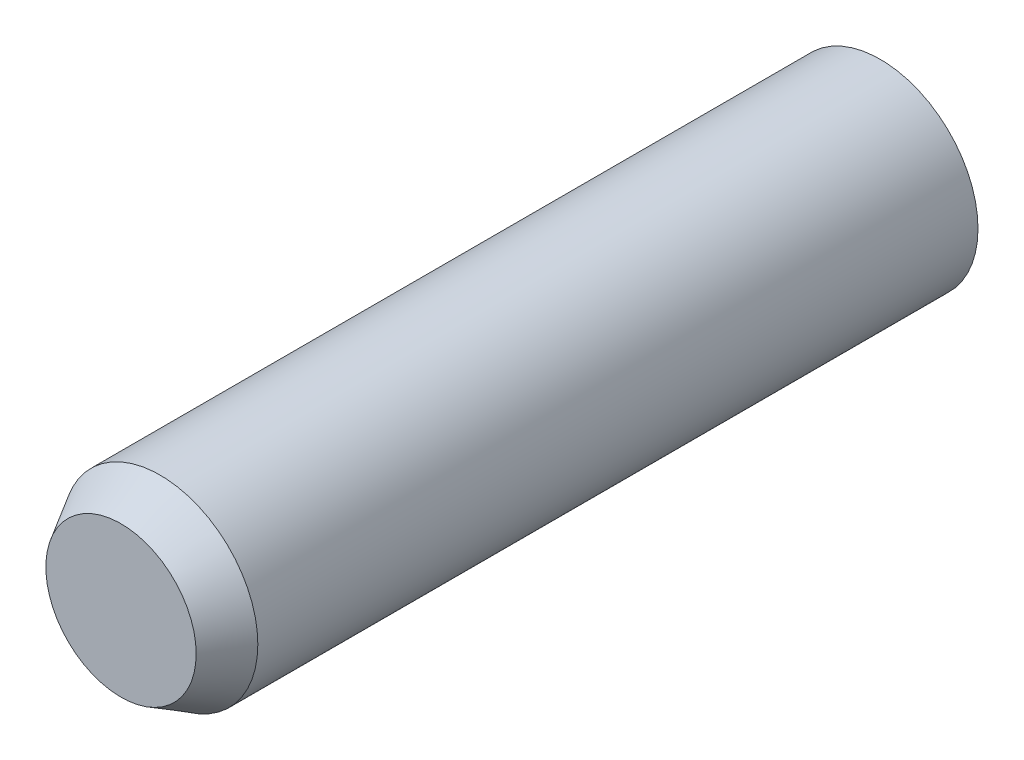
ISO-10303-21;
HEADER;
FILE_DESCRIPTION(('STEP AP214'),'2;1');
FILE_NAME('part.step','',(''),(''),'','','');
FILE_SCHEMA(('AUTOMOTIVE_DESIGN { 1 0 10303 214 1 1 1 1 }'));
ENDSEC;
DATA;
#1=APPLICATION_CONTEXT('core data for automotive mechanical design processes');
#2=APPLICATION_PROTOCOL_DEFINITION('international standard','automotive_design',2000,#1);
#3=PRODUCT_CONTEXT('',#1,'mechanical');
#4=PRODUCT('Part','Part','',(#3));
#5=PRODUCT_RELATED_PRODUCT_CATEGORY('part','',(#4));
#6=PRODUCT_DEFINITION_FORMATION('','',#4);
#7=PRODUCT_DEFINITION_CONTEXT('part definition',#1,'design');
#8=PRODUCT_DEFINITION('design','',#6,#7);
#9=PRODUCT_DEFINITION_SHAPE('','',#8);
#10=(LENGTH_UNIT() NAMED_UNIT(*) SI_UNIT(.MILLI.,.METRE.));
#11=(NAMED_UNIT(*) PLANE_ANGLE_UNIT() SI_UNIT($,.RADIAN.));
#12=(NAMED_UNIT(*) SI_UNIT($,.STERADIAN.) SOLID_ANGLE_UNIT());
#13=UNCERTAINTY_MEASURE_WITH_UNIT(LENGTH_MEASURE(1.E-05),#10,'distance_accuracy_value','');
#14=(GEOMETRIC_REPRESENTATION_CONTEXT(3) GLOBAL_UNCERTAINTY_ASSIGNED_CONTEXT((#13)) GLOBAL_UNIT_ASSIGNED_CONTEXT((#10,
#11,#12)) REPRESENTATION_CONTEXT('',''));
#15=CARTESIAN_POINT('',(0.,0.,0.));
#16=DIRECTION('',(0.,0.,1.));
#17=DIRECTION('',(1.,0.,0.));
#18=AXIS2_PLACEMENT_3D('',#15,#16,#17);
#19=CARTESIAN_POINT('',(0.,0.,50.8));
#20=DIRECTION('',(0.,0.,-1.));
#21=DIRECTION('',(-1.,0.,0.));
#22=AXIS2_PLACEMENT_3D('',#19,#20,#21);
#23=CYLINDRICAL_SURFACE('',#22,6.35);
#24=CARTESIAN_POINT('',(0.,0.,1.46646968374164));
#25=DIRECTION('',(0.,0.,1.));
#26=DIRECTION('',(1.,0.,0.));
#27=AXIS2_PLACEMENT_3D('',#24,#25,#26);
#28=CIRCLE('',#27,6.35);
#29=CARTESIAN_POINT('',(6.35,0.,1.46646968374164));
#30=VERTEX_POINT('',#29);
#31=EDGE_CURVE('E42',#30,#30,#28,.T.);
#32=ORIENTED_EDGE('',*,*,#31,.T.);
#33=EDGE_LOOP('',(#32));
#34=FACE_BOUND('',#33,.T.);
#35=CARTESIAN_POINT('',(0.,0.,48.26));
#36=DIRECTION('',(0.,0.,1.));
#37=DIRECTION('',(1.,0.,0.));
#38=AXIS2_PLACEMENT_3D('',#35,#36,#37);
#39=CIRCLE('',#38,6.35);
#40=CARTESIAN_POINT('',(6.35,0.,48.26));
#41=VERTEX_POINT('',#40);
#42=EDGE_CURVE('E46',#41,#41,#39,.F.);
#43=ORIENTED_EDGE('',*,*,#42,.T.);
#44=EDGE_LOOP('',(#43));
#45=FACE_BOUND('',#44,.T.);
#46=ADVANCED_FACE('F31',(#34,#45),#23,.T.);
#47=CARTESIAN_POINT('',(0.,0.,50.8));
#48=DIRECTION('',(0.,0.,1.));
#49=DIRECTION('',(1.,0.,0.));
#50=AXIS2_PLACEMENT_3D('',#47,#48,#49);
#51=PLANE('',#50);
#52=CARTESIAN_POINT('',(0.,0.,50.8));
#53=DIRECTION('',(0.,0.,1.));
#54=DIRECTION('',(1.,0.,0.));
#55=AXIS2_PLACEMENT_3D('',#52,#53,#54);
#56=CIRCLE('',#55,4.88353031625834);
#57=CARTESIAN_POINT('',(4.88353031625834,0.,50.8));
#58=VERTEX_POINT('',#57);
#59=EDGE_CURVE('E10',#58,#58,#56,.T.);
#60=ORIENTED_EDGE('',*,*,#59,.T.);
#61=EDGE_LOOP('',(#60));
#62=FACE_BOUND('',#61,.T.);
#63=ADVANCED_FACE('F62',(#62),#51,.T.);
#64=CARTESIAN_POINT('',(0.,0.,0.));
#65=DIRECTION('',(0.,0.,1.));
#66=DIRECTION('',(1.,0.,0.));
#67=AXIS2_PLACEMENT_3D('',#64,#65,#66);
#68=PLANE('',#67);
#69=CARTESIAN_POINT('',(0.,0.,0.));
#70=DIRECTION('',(0.,0.,1.));
#71=DIRECTION('',(1.,0.,0.));
#72=AXIS2_PLACEMENT_3D('',#69,#70,#71);
#73=CIRCLE('',#72,3.81);
#74=CARTESIAN_POINT('',(3.81,0.,0.));
#75=VERTEX_POINT('',#74);
#76=EDGE_CURVE('E38',#75,#75,#73,.F.);
#77=ORIENTED_EDGE('',*,*,#76,.T.);
#78=EDGE_LOOP('',(#77));
#79=FACE_BOUND('',#78,.T.);
#80=ADVANCED_FACE('F59',(#79),#68,.F.);
#81=CARTESIAN_POINT('',(0.,0.,1.46646968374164));
#82=DIRECTION('',(0.,0.,1.));
#83=DIRECTION('',(1.,0.,0.));
#84=AXIS2_PLACEMENT_3D('',#81,#82,#83);
#85=CONICAL_SURFACE('',#84,6.35,1.0471975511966);
#86=ORIENTED_EDGE('',*,*,#76,.F.);
#87=EDGE_LOOP('',(#86));
#88=FACE_BOUND('',#87,.T.);
#89=ORIENTED_EDGE('',*,*,#31,.F.);
#90=EDGE_LOOP('',(#89));
#91=FACE_BOUND('',#90,.T.);
#92=ADVANCED_FACE('F55',(#88,#91),#85,.T.);
#93=CARTESIAN_POINT('',(0.,0.,50.8));
#94=DIRECTION('',(0.,0.,-1.));
#95=DIRECTION('',(-1.,0.,0.));
#96=AXIS2_PLACEMENT_3D('',#93,#94,#95);
#97=CONICAL_SURFACE('',#96,4.88353031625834,0.523598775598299);
#98=ORIENTED_EDGE('',*,*,#42,.F.);
#99=EDGE_LOOP('',(#98));
#100=FACE_BOUND('',#99,.T.);
#101=ORIENTED_EDGE('',*,*,#59,.F.);
#102=EDGE_LOOP('',(#101));
#103=FACE_BOUND('',#102,.T.);
#104=ADVANCED_FACE('F33',(#100,#103),#97,.T.);
#105=CLOSED_SHELL('',(#46,#63,#80,#92,#104));
#106=MANIFOLD_SOLID_BREP('B2',#105);
#107=ADVANCED_BREP_SHAPE_REPRESENTATION('',(#18,#106),#14);
#108=SHAPE_DEFINITION_REPRESENTATION(#9,#107);
ENDSEC;
END-ISO-10303-21;
